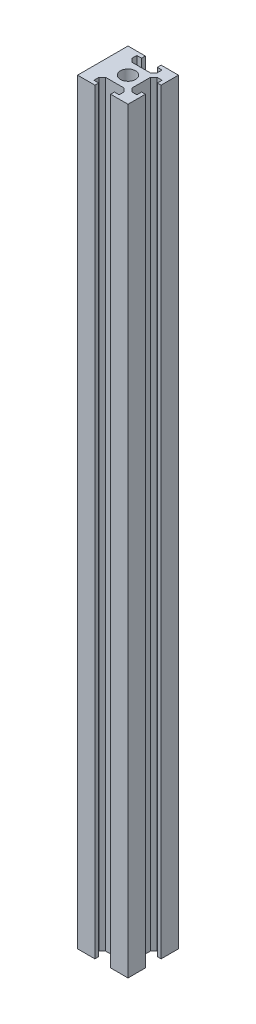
from build123d import *

# Parameters (mm, degrees)
SKIZZE1_R                       = 3
AUFSATZ_LINEAR_AUSTRAGEN1_DEPTH = 300


with BuildPart() as part:
    # Skizze1 → Aufsatz-Linear austragen1 (new body)
    with BuildSketch(Plane(origin=(0, 0, 0), x_dir=(1, 0, 0), z_dir=(0, 1, 0))):
        Polygon((-3.125, 10), (-3.125, 8.5), (-5, 8.5), (-5, 6.504827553), (-3.707168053, 5.2), (3.707168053, 5.2), (5, 6.504827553), (5, 8.5), (3.125, 8.5), (3.125, 10), (10, 10), (10, 3.125), (8.5, 3.125), (8.5, 5), (6.504827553, 5), (5.2, 3.707168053), (5.2, -3.707168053), (6.504827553, -5), (8.5, -5), (8.5, -3.125), (10, -3.125), (10, -10), (3.125, -10), (3.125, -8.5), (5, -8.5), (5, -6.504827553), (3.707168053, -5.2), (-3.707168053, -5.2), (-5, -6.504827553), (-5, -8.5), (-3.125, -8.5), (-3.125, -10), (-10, -10), (-10, 10), align=None)
        with Locations(Location((0, 0, 0), (0, 0, 270))):
            Circle(SKIZZE1_R, mode=Mode.SUBTRACT)
    extrude(amount=AUFSATZ_LINEAR_AUSTRAGEN1_DEPTH)


solid = part.part
